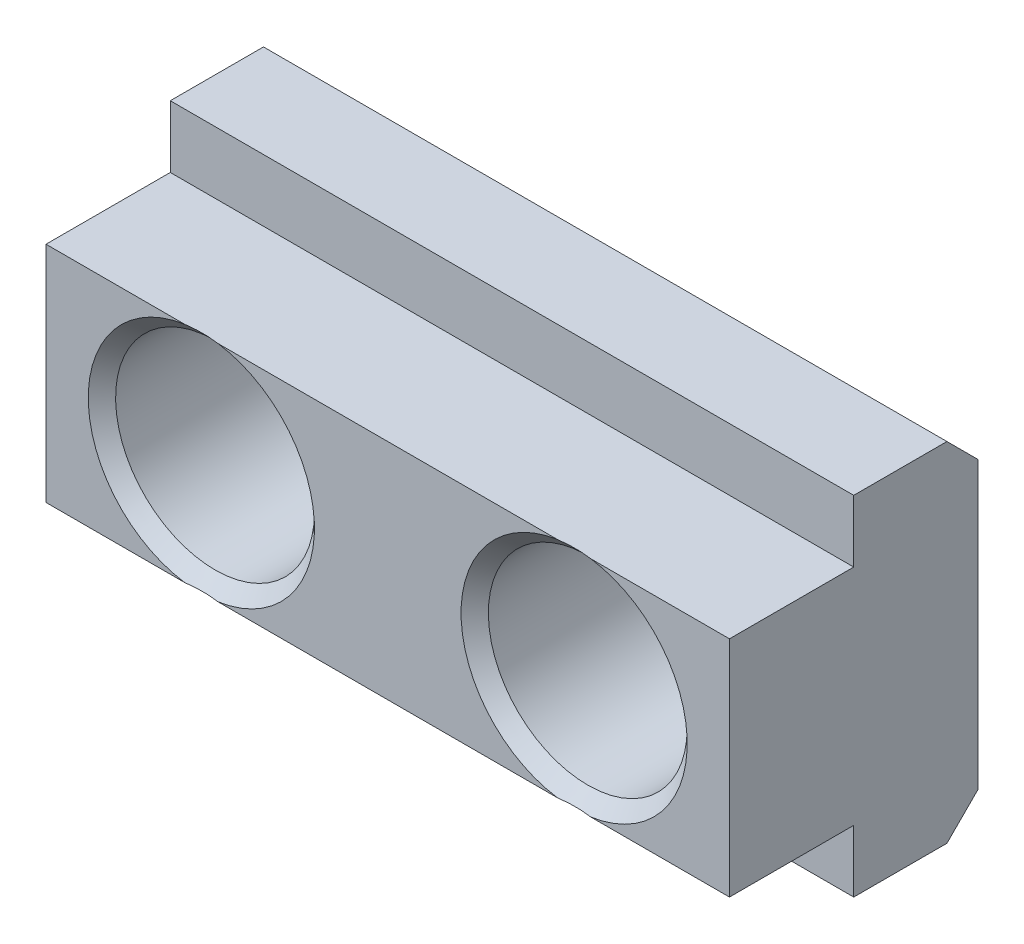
ISO-10303-21;
HEADER;
FILE_DESCRIPTION(('STEP AP214'),'2;1');
FILE_NAME('part.step','',(''),(''),'','','');
FILE_SCHEMA(('AUTOMOTIVE_DESIGN { 1 0 10303 214 1 1 1 1 }'));
ENDSEC;
DATA;
#1=APPLICATION_CONTEXT('core data for automotive mechanical design processes');
#2=APPLICATION_PROTOCOL_DEFINITION('international standard','automotive_design',2000,#1);
#3=PRODUCT_CONTEXT('',#1,'mechanical');
#4=PRODUCT('Part','Part','',(#3));
#5=PRODUCT_RELATED_PRODUCT_CATEGORY('part','',(#4));
#6=PRODUCT_DEFINITION_FORMATION('','',#4);
#7=PRODUCT_DEFINITION_CONTEXT('part definition',#1,'design');
#8=PRODUCT_DEFINITION('design','',#6,#7);
#9=PRODUCT_DEFINITION_SHAPE('','',#8);
#10=(LENGTH_UNIT() NAMED_UNIT(*) SI_UNIT(.MILLI.,.METRE.));
#11=(NAMED_UNIT(*) PLANE_ANGLE_UNIT() SI_UNIT($,.RADIAN.));
#12=(NAMED_UNIT(*) SI_UNIT($,.STERADIAN.) SOLID_ANGLE_UNIT());
#13=UNCERTAINTY_MEASURE_WITH_UNIT(LENGTH_MEASURE(1.E-05),#10,'distance_accuracy_value','');
#14=(GEOMETRIC_REPRESENTATION_CONTEXT(3) GLOBAL_UNCERTAINTY_ASSIGNED_CONTEXT((#13)) GLOBAL_UNIT_ASSIGNED_CONTEXT((#10,
#11,#12)) REPRESENTATION_CONTEXT('',''));
#15=CARTESIAN_POINT('',(0.,0.,0.));
#16=DIRECTION('',(0.,0.,1.));
#17=DIRECTION('',(1.,0.,0.));
#18=AXIS2_PLACEMENT_3D('',#15,#16,#17);
#19=CARTESIAN_POINT('',(-12.5,9.,20.));
#20=DIRECTION('',(0.,0.,-1.));
#21=DIRECTION('',(0.,-1.,0.));
#22=AXIS2_PLACEMENT_3D('',#19,#20,#21);
#23=PLANE('',#22);
#24=DIRECTION('',(1.,0.,0.));
#25=VECTOR('',#24,1.);
#26=CARTESIAN_POINT('',(-12.5,-9.,20.));
#27=LINE('',#26,#25);
#28=CARTESIAN_POINT('',(-12.5,-9.,20.));
#29=VERTEX_POINT('',#28);
#30=CARTESIAN_POINT('',(-1.34536240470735,-9.,20.));
#31=VERTEX_POINT('',#30);
#32=EDGE_CURVE('E128',#29,#31,#27,.T.);
#33=ORIENTED_EDGE('',*,*,#32,.T.);
#34=CARTESIAN_POINT('',(0.,0.,20.));
#35=DIRECTION('',(0.,0.,1.));
#36=DIRECTION('',(0.,1.,0.));
#37=AXIS2_PLACEMENT_3D('',#34,#35,#36);
#38=CIRCLE('',#37,9.1);
#39=CARTESIAN_POINT('',(-1.3453624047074,9.,20.));
#40=VERTEX_POINT('',#39);
#41=EDGE_CURVE('E116',#40,#31,#38,.T.);
#42=ORIENTED_EDGE('',*,*,#41,.F.);
#43=DIRECTION('',(1.,0.,0.));
#44=VECTOR('',#43,1.);
#45=CARTESIAN_POINT('',(-12.5,9.,20.));
#46=LINE('',#45,#44);
#47=CARTESIAN_POINT('',(-12.5,9.,20.));
#48=VERTEX_POINT('',#47);
#49=EDGE_CURVE('E125',#48,#40,#46,.T.);
#50=ORIENTED_EDGE('',*,*,#49,.F.);
#51=DIRECTION('',(0.,1.,0.));
#52=VECTOR('',#51,1.);
#53=CARTESIAN_POINT('',(-12.5,9.,20.));
#54=LINE('',#53,#52);
#55=EDGE_CURVE('E182',#29,#48,#54,.T.);
#56=ORIENTED_EDGE('',*,*,#55,.F.);
#57=EDGE_LOOP('',(#33,#42,#50,#56));
#58=FACE_BOUND('',#57,.T.);
#59=ADVANCED_FACE('F14',(#58),#23,.F.);
#60=CARTESIAN_POINT('',(1.34536240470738,9.,20.));
#61=VERTEX_POINT('',#60);
#62=CARTESIAN_POINT('',(28.6546375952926,9.,20.));
#63=VERTEX_POINT('',#62);
#64=EDGE_CURVE('E135',#61,#63,#46,.T.);
#65=ORIENTED_EDGE('',*,*,#64,.F.);
#66=CARTESIAN_POINT('',(1.34536240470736,-9.,20.));
#67=VERTEX_POINT('',#66);
#68=EDGE_CURVE('E31',#67,#61,#38,.T.);
#69=ORIENTED_EDGE('',*,*,#68,.F.);
#70=CARTESIAN_POINT('',(28.6546375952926,-9.,20.));
#71=VERTEX_POINT('',#70);
#72=EDGE_CURVE('E138',#67,#71,#27,.T.);
#73=ORIENTED_EDGE('',*,*,#72,.T.);
#74=CARTESIAN_POINT('',(30.,0.,20.));
#75=DIRECTION('',(0.,0.,1.));
#76=DIRECTION('',(0.,1.,0.));
#77=AXIS2_PLACEMENT_3D('',#74,#75,#76);
#78=CIRCLE('',#77,9.1);
#79=EDGE_CURVE('E257',#63,#71,#78,.T.);
#80=ORIENTED_EDGE('',*,*,#79,.F.);
#81=EDGE_LOOP('',(#65,#69,#73,#80));
#82=FACE_BOUND('',#81,.T.);
#83=ADVANCED_FACE('F236',(#82),#23,.F.);
#84=CARTESIAN_POINT('',(-12.5,-14.,10.));
#85=DIRECTION('',(0.,1.,0.));
#86=DIRECTION('',(0.,0.,-1.));
#87=AXIS2_PLACEMENT_3D('',#84,#85,#86);
#88=PLANE('',#87);
#89=DIRECTION('',(0.,0.,1.));
#90=VECTOR('',#89,1.);
#91=CARTESIAN_POINT('',(-12.5,-14.,10.));
#92=LINE('',#91,#90);
#93=CARTESIAN_POINT('',(-12.5,-14.,2.5));
#94=VERTEX_POINT('',#93);
#95=CARTESIAN_POINT('',(-12.5,-14.,10.));
#96=VERTEX_POINT('',#95);
#97=EDGE_CURVE('E156',#94,#96,#92,.T.);
#98=ORIENTED_EDGE('',*,*,#97,.F.);
#99=DIRECTION('',(1.,0.,0.));
#100=VECTOR('',#99,1.);
#101=CARTESIAN_POINT('',(-12.5,-14.,2.5));
#102=LINE('',#101,#100);
#103=CARTESIAN_POINT('',(42.5,-14.,2.5));
#104=VERTEX_POINT('',#103);
#105=EDGE_CURVE('E342',#94,#104,#102,.T.);
#106=ORIENTED_EDGE('',*,*,#105,.T.);
#107=DIRECTION('',(0.,0.,1.));
#108=VECTOR('',#107,1.);
#109=CARTESIAN_POINT('',(42.5,-14.,10.));
#110=LINE('',#109,#108);
#111=CARTESIAN_POINT('',(42.5,-14.,10.));
#112=VERTEX_POINT('',#111);
#113=EDGE_CURVE('E171',#104,#112,#110,.T.);
#114=ORIENTED_EDGE('',*,*,#113,.T.);
#115=DIRECTION('',(1.,0.,0.));
#116=VECTOR('',#115,1.);
#117=CARTESIAN_POINT('',(-12.5,-14.,10.));
#118=LINE('',#117,#116);
#119=EDGE_CURVE('E344',#96,#112,#118,.T.);
#120=ORIENTED_EDGE('',*,*,#119,.F.);
#121=EDGE_LOOP('',(#98,#106,#114,#120));
#122=FACE_BOUND('',#121,.T.);
#123=ADVANCED_FACE('F246',(#122),#88,.F.);
#124=CARTESIAN_POINT('',(-12.5,-9.,10.));
#125=DIRECTION('',(0.,0.,-1.));
#126=DIRECTION('',(0.,-1.,0.));
#127=AXIS2_PLACEMENT_3D('',#124,#125,#126);
#128=PLANE('',#127);
#129=DIRECTION('',(0.,1.,0.));
#130=VECTOR('',#129,1.);
#131=CARTESIAN_POINT('',(42.5,-9.,10.));
#132=LINE('',#131,#130);
#133=CARTESIAN_POINT('',(42.5,-9.,10.));
#134=VERTEX_POINT('',#133);
#135=EDGE_CURVE('E169',#112,#134,#132,.T.);
#136=ORIENTED_EDGE('',*,*,#135,.T.);
#137=DIRECTION('',(1.,0.,0.));
#138=VECTOR('',#137,1.);
#139=CARTESIAN_POINT('',(-12.5,-9.,10.));
#140=LINE('',#139,#138);
#141=CARTESIAN_POINT('',(-12.5,-9.,10.));
#142=VERTEX_POINT('',#141);
#143=EDGE_CURVE('E349',#142,#134,#140,.T.);
#144=ORIENTED_EDGE('',*,*,#143,.F.);
#145=DIRECTION('',(0.,1.,0.));
#146=VECTOR('',#145,1.);
#147=CARTESIAN_POINT('',(-12.5,-9.,10.));
#148=LINE('',#147,#146);
#149=EDGE_CURVE('E186',#96,#142,#148,.T.);
#150=ORIENTED_EDGE('',*,*,#149,.F.);
#151=ORIENTED_EDGE('',*,*,#119,.T.);
#152=EDGE_LOOP('',(#136,#144,#150,#151));
#153=FACE_BOUND('',#152,.T.);
#154=ADVANCED_FACE('F242',(#153),#128,.F.);
#155=CARTESIAN_POINT('',(-12.5,-9.,20.));
#156=DIRECTION('',(0.,1.,0.));
#157=DIRECTION('',(0.,0.,-1.));
#158=AXIS2_PLACEMENT_3D('',#155,#156,#157);
#159=PLANE('',#158);
#160=ORIENTED_EDGE('',*,*,#72,.F.);
#161=CARTESIAN_POINT('',(19.4489634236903,-9.,32.3304031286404));
#162=CARTESIAN_POINT('',(19.035900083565,-9.,31.9555709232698));
#163=CARTESIAN_POINT('',(18.6218227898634,-9.,31.58184864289));
#164=CARTESIAN_POINT('',(17.7911512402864,-9.,30.837170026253));
#165=CARTESIAN_POINT('',(17.3745568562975,-9.,30.4662138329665));
#166=CARTESIAN_POINT('',(16.5374420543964,-9.,29.7268020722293));
#167=CARTESIAN_POINT('',(16.1169148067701,-9.,29.358354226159));
#168=CARTESIAN_POINT('',(15.272259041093,-9.,28.6256233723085));
#169=CARTESIAN_POINT('',(14.8481305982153,-9.,28.2613402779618));
#170=CARTESIAN_POINT('',(13.95665798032,-9.,27.5050461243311));
#171=CARTESIAN_POINT('',(13.4888937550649,-9.,27.1135288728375));
#172=CARTESIAN_POINT('',(12.5467436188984,-9.,26.3385549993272));
#173=CARTESIAN_POINT('',(12.0723578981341,-9.,25.9550981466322));
#174=CARTESIAN_POINT('',(11.1155702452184,-9.,25.1992884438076));
#175=CARTESIAN_POINT('',(10.6331772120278,-9.,24.8269244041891));
#176=CARTESIAN_POINT('',(9.90132783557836,-9.,24.279472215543));
#177=CARTESIAN_POINT('',(9.65601353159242,-9.,24.0988456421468));
#178=CARTESIAN_POINT('',(9.16220726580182,-9.,23.7419960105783));
#179=CARTESIAN_POINT('',(8.91371540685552,-9.,23.5657728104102));
#180=CARTESIAN_POINT('',(8.40474323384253,-9.,23.2127974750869));
#181=CARTESIAN_POINT('',(8.14413926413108,-9.,23.0362231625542));
#182=CARTESIAN_POINT('',(7.61844979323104,-9.,22.6898967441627));
#183=CARTESIAN_POINT('',(7.35336462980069,-9.,22.5201441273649));
#184=CARTESIAN_POINT('',(6.8176146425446,-9.,22.1887330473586));
#185=CARTESIAN_POINT('',(6.54694210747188,-9.,22.027086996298));
#186=CARTESIAN_POINT('',(5.99966078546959,-9.,21.7141354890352));
#187=CARTESIAN_POINT('',(5.72305218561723,-9.,21.5628297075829));
#188=CARTESIAN_POINT('',(5.16962404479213,-9.,21.2764279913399));
#189=CARTESIAN_POINT('',(4.89295782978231,-9.,21.1410377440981));
#190=CARTESIAN_POINT('',(4.33257764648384,-9.,20.8854425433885));
#191=CARTESIAN_POINT('',(4.04886252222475,-9.,20.765240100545));
#192=CARTESIAN_POINT('',(3.47494537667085,-9.,20.5439291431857));
#193=CARTESIAN_POINT('',(3.18476441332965,-9.,20.4427665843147));
#194=CARTESIAN_POINT('',(2.59753433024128,-9.,20.2631842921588));
#195=CARTESIAN_POINT('',(2.30049000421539,-9.,20.1847491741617));
#196=CARTESIAN_POINT('',(1.77741180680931,-9.,20.0712439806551));
#197=CARTESIAN_POINT('',(1.55266973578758,-9.,20.0302126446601));
#198=CARTESIAN_POINT('',(1.10078097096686,-9.,19.9643140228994));
#199=CARTESIAN_POINT('',(0.873634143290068,-9.,19.9394476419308));
#200=CARTESIAN_POINT('',(0.418379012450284,-9.,19.906862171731));
#201=CARTESIAN_POINT('',(0.190272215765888,-9.,19.8991222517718));
#202=CARTESIAN_POINT('',(-0.265869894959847,-9.,19.9010364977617));
#203=CARTESIAN_POINT('',(-0.493905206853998,-9.,19.9106911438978));
#204=CARTESIAN_POINT('',(-0.980721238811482,-9.,19.9495831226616));
#205=CARTESIAN_POINT('',(-1.23929674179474,-9.,19.9813930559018));
#206=CARTESIAN_POINT('',(-1.75310125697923,-9.,20.0656463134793));
#207=CARTESIAN_POINT('',(-2.00832935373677,-9.,20.1180951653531));
#208=CARTESIAN_POINT('',(-2.38899117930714,-9.,20.2108484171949));
#209=CARTESIAN_POINT('',(-2.51614163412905,-9.,20.2443149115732));
#210=CARTESIAN_POINT('',(-2.76917657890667,-9.,20.3156048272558));
#211=CARTESIAN_POINT('',(-2.89506143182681,-9.,20.3534269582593));
#212=CARTESIAN_POINT('',(-3.27073621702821,-9.,20.472948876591));
#213=CARTESIAN_POINT('',(-3.51860487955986,-9.,20.5607187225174));
#214=CARTESIAN_POINT('',(-4.1076520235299,-9.,20.7879755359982));
#215=CARTESIAN_POINT('',(-4.4462653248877,-9.,20.9340654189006));
#216=CARTESIAN_POINT('',(-5.11376654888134,-9.,21.2471565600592));
#217=CARTESIAN_POINT('',(-5.4426488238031,-9.,21.4141696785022));
#218=CARTESIAN_POINT('',(-6.09285341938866,-9.,21.7649746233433));
#219=CARTESIAN_POINT('',(-6.41414294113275,-9.,21.9488267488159));
#220=CARTESIAN_POINT('',(-7.04904977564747,-9.,22.3291081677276));
#221=CARTESIAN_POINT('',(-7.36266861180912,-9.,22.525534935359));
#222=CARTESIAN_POINT('',(-7.96861210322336,-9.,22.9186617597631));
#223=CARTESIAN_POINT('',(-8.26123802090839,-9.,23.1148998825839));
#224=CARTESIAN_POINT('',(-8.84152677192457,-9.,23.5146100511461));
#225=CARTESIAN_POINT('',(-9.12918919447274,-9.,23.7180826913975));
#226=CARTESIAN_POINT('',(-9.69771119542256,-9.,24.1290318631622));
#227=CARTESIAN_POINT('',(-9.97860862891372,-9.,24.3364562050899));
#228=CARTESIAN_POINT('',(-10.5367418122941,-9.,24.7560263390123));
#229=CARTESIAN_POINT('',(-10.8139785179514,-9.,24.9681708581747));
#230=CARTESIAN_POINT('',(-11.0897133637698,-9.,25.1822177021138));
#231=B_SPLINE_CURVE_WITH_KNOTS('',3,(#161,#162,#163,#164,#165,#166,#167,#168,#169,#170,#171,
#172,#173,#174,#175,#176,#177,#178,#179,#180,#181,#182,#183,#184,#185,#186,#187,#188,#189,#190,
#191,#192,#193,#194,#195,#196,#197,#198,#199,#200,#201,#202,#203,#204,#205,#206,#207,#208,#209,
#210,#211,#212,#213,#214,#215,#216,#217,#218,#219,#220,#221,#222,#223,#224,#225,#226,#227,#228,
#229,#230),.UNSPECIFIED.,.F.,.F.,(4,2,2,2,2,2,2,2,2,2,2,2,2,2,2,2,2,2,2,2,2,2,2,2,2,2,2,2,2,2,2,
2,2,2,4),(0.,1.67335071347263,3.34678732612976,5.02407585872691,6.70132946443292,
8.53123159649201,10.3610812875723,12.189017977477,13.1028974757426,14.0167474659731,
14.9610306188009,15.9052429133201,16.8508593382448,17.7964460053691,18.7201276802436,
19.643961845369,20.5651328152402,21.485678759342,22.1705265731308,22.8554127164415,
23.5394653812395,24.2235369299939,25.0041999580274,25.7850722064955,26.1794494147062,
26.5737100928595,27.3620509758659,28.4674473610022,29.5734731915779,30.6836272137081,
31.7935589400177,32.8504320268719,33.9073921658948,34.95488475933,36.0020982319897),.UNSPECIFIED.);
#232=EDGE_CURVE('E263',#67,#31,#231,.T.);
#233=ORIENTED_EDGE('',*,*,#232,.T.);
#234=ORIENTED_EDGE('',*,*,#32,.F.);
#235=DIRECTION('',(0.,0.,1.));
#236=VECTOR('',#235,1.);
#237=CARTESIAN_POINT('',(-12.5,-9.,20.));
#238=LINE('',#237,#236);
#239=EDGE_CURVE('E184',#142,#29,#238,.T.);
#240=ORIENTED_EDGE('',*,*,#239,.F.);
#241=ORIENTED_EDGE('',*,*,#143,.T.);
#242=DIRECTION('',(0.,0.,1.));
#243=VECTOR('',#242,1.);
#244=CARTESIAN_POINT('',(42.5,-9.,20.));
#245=LINE('',#244,#243);
#246=CARTESIAN_POINT('',(42.5,-9.,20.));
#247=VERTEX_POINT('',#246);
#248=EDGE_CURVE('E166',#134,#247,#245,.T.);
#249=ORIENTED_EDGE('',*,*,#248,.T.);
#250=CARTESIAN_POINT('',(31.3453624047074,-9.,20.));
#251=VERTEX_POINT('',#250);
#252=EDGE_CURVE('E134',#251,#247,#27,.T.);
#253=ORIENTED_EDGE('',*,*,#252,.F.);
#254=CARTESIAN_POINT('',(49.4489634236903,-9.,32.3304031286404));
#255=CARTESIAN_POINT('',(49.035900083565,-9.,31.9555709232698));
#256=CARTESIAN_POINT('',(48.6218227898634,-9.,31.58184864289));
#257=CARTESIAN_POINT('',(47.7911512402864,-9.,30.837170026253));
#258=CARTESIAN_POINT('',(47.3745568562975,-9.,30.4662138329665));
#259=CARTESIAN_POINT('',(46.5374420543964,-9.,29.7268020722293));
#260=CARTESIAN_POINT('',(46.1169148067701,-9.,29.358354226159));
#261=CARTESIAN_POINT('',(45.272259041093,-9.,28.6256233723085));
#262=CARTESIAN_POINT('',(44.8481305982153,-9.,28.2613402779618));
#263=CARTESIAN_POINT('',(43.95665798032,-9.,27.5050461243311));
#264=CARTESIAN_POINT('',(43.4888937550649,-9.,27.1135288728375));
#265=CARTESIAN_POINT('',(42.5467436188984,-9.,26.3385549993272));
#266=CARTESIAN_POINT('',(42.0723578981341,-9.,25.9550981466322));
#267=CARTESIAN_POINT('',(41.1155702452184,-9.,25.1992884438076));
#268=CARTESIAN_POINT('',(40.6331772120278,-9.,24.8269244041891));
#269=CARTESIAN_POINT('',(39.9013278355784,-9.,24.279472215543));
#270=CARTESIAN_POINT('',(39.6560135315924,-9.,24.0988456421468));
#271=CARTESIAN_POINT('',(39.1622072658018,-9.,23.7419960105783));
#272=CARTESIAN_POINT('',(38.9137154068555,-9.,23.5657728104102));
#273=CARTESIAN_POINT('',(38.4047432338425,-9.,23.2127974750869));
#274=CARTESIAN_POINT('',(38.1441392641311,-9.,23.0362231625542));
#275=CARTESIAN_POINT('',(37.618449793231,-9.,22.6898967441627));
#276=CARTESIAN_POINT('',(37.3533646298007,-9.,22.5201441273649));
#277=CARTESIAN_POINT('',(36.8176146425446,-9.,22.1887330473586));
#278=CARTESIAN_POINT('',(36.5469421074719,-9.,22.027086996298));
#279=CARTESIAN_POINT('',(35.9996607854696,-9.,21.7141354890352));
#280=CARTESIAN_POINT('',(35.7230521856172,-9.,21.5628297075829));
#281=CARTESIAN_POINT('',(35.1696240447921,-9.,21.2764279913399));
#282=CARTESIAN_POINT('',(34.8929578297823,-9.,21.1410377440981));
#283=CARTESIAN_POINT('',(34.3325776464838,-9.,20.8854425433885));
#284=CARTESIAN_POINT('',(34.0488625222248,-9.,20.765240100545));
#285=CARTESIAN_POINT('',(33.4749453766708,-9.,20.5439291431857));
#286=CARTESIAN_POINT('',(33.1847644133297,-9.,20.4427665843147));
#287=CARTESIAN_POINT('',(32.5975343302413,-9.,20.2631842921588));
#288=CARTESIAN_POINT('',(32.3004900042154,-9.,20.1847491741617));
#289=CARTESIAN_POINT('',(31.7774118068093,-9.,20.0712439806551));
#290=CARTESIAN_POINT('',(31.5526697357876,-9.,20.0302126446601));
#291=CARTESIAN_POINT('',(31.1007809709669,-9.,19.9643140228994));
#292=CARTESIAN_POINT('',(30.8736341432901,-9.,19.9394476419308));
#293=CARTESIAN_POINT('',(30.4183790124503,-9.,19.906862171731));
#294=CARTESIAN_POINT('',(30.1902722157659,-9.,19.8991222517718));
#295=CARTESIAN_POINT('',(29.7341301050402,-9.,19.9010364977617));
#296=CARTESIAN_POINT('',(29.506094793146,-9.,19.9106911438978));
#297=CARTESIAN_POINT('',(29.0192787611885,-9.,19.9495831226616));
#298=CARTESIAN_POINT('',(28.7607032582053,-9.,19.9813930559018));
#299=CARTESIAN_POINT('',(28.2468987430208,-9.,20.0656463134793));
#300=CARTESIAN_POINT('',(27.9916706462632,-9.,20.1180951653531));
#301=CARTESIAN_POINT('',(27.6110088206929,-9.,20.2108484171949));
#302=CARTESIAN_POINT('',(27.4838583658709,-9.,20.2443149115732));
#303=CARTESIAN_POINT('',(27.2308234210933,-9.,20.3156048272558));
#304=CARTESIAN_POINT('',(27.1049385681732,-9.,20.3534269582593));
#305=CARTESIAN_POINT('',(26.7292637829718,-9.,20.472948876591));
#306=CARTESIAN_POINT('',(26.4813951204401,-9.,20.5607187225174));
#307=CARTESIAN_POINT('',(25.8923479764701,-9.,20.7879755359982));
#308=CARTESIAN_POINT('',(25.5537346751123,-9.,20.9340654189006));
#309=CARTESIAN_POINT('',(24.8862334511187,-9.,21.2471565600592));
#310=CARTESIAN_POINT('',(24.5573511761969,-9.,21.4141696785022));
#311=CARTESIAN_POINT('',(23.9071465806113,-9.,21.7649746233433));
#312=CARTESIAN_POINT('',(23.5858570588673,-9.,21.9488267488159));
#313=CARTESIAN_POINT('',(22.9509502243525,-9.,22.3291081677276));
#314=CARTESIAN_POINT('',(22.6373313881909,-9.,22.525534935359));
#315=CARTESIAN_POINT('',(22.0313878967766,-9.,22.9186617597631));
#316=CARTESIAN_POINT('',(21.7387619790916,-9.,23.1148998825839));
#317=CARTESIAN_POINT('',(21.1584732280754,-9.,23.5146100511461));
#318=CARTESIAN_POINT('',(20.8708108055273,-9.,23.7180826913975));
#319=CARTESIAN_POINT('',(20.3022888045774,-9.,24.1290318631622));
#320=CARTESIAN_POINT('',(20.0213913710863,-9.,24.3364562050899));
#321=CARTESIAN_POINT('',(19.4632581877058,-9.,24.7560263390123));
#322=CARTESIAN_POINT('',(19.1860214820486,-9.,24.9681708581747));
#323=CARTESIAN_POINT('',(18.9102866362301,-9.,25.1822177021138));
#324=B_SPLINE_CURVE_WITH_KNOTS('',3,(#254,#255,#256,#257,#258,#259,#260,#261,#262,#263,#264,
#265,#266,#267,#268,#269,#270,#271,#272,#273,#274,#275,#276,#277,#278,#279,#280,#281,#282,#283,
#284,#285,#286,#287,#288,#289,#290,#291,#292,#293,#294,#295,#296,#297,#298,#299,#300,#301,#302,
#303,#304,#305,#306,#307,#308,#309,#310,#311,#312,#313,#314,#315,#316,#317,#318,#319,#320,#321,
#322,#323),.UNSPECIFIED.,.F.,.F.,(4,2,2,2,2,2,2,2,2,2,2,2,2,2,2,2,2,2,2,2,2,2,2,2,2,2,2,2,2,2,2,
2,2,2,4),(0.,1.67335071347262,3.34678732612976,5.0240758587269,6.70132946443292,
8.53123159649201,10.3610812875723,12.189017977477,13.1028974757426,14.0167474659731,
14.9610306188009,15.9052429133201,16.8508593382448,17.796446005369,18.7201276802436,
19.643961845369,20.5651328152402,21.485678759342,22.1705265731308,22.8554127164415,
23.5394653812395,24.2235369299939,25.0041999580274,25.7850722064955,26.1794494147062,
26.5737100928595,27.3620509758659,28.4674473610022,29.5734731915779,30.6836272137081,
31.7935589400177,32.8504320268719,33.9073921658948,34.95488475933,36.0020982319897),.UNSPECIFIED.);
#325=EDGE_CURVE('E173',#251,#71,#324,.T.);
#326=ORIENTED_EDGE('',*,*,#325,.T.);
#327=EDGE_LOOP('',(#160,#233,#234,#240,#241,#249,#253,#326));
#328=FACE_BOUND('',#327,.T.);
#329=ADVANCED_FACE('F199',(#328),#159,.F.);
#330=CARTESIAN_POINT('',(31.3453624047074,9.,20.));
#331=VERTEX_POINT('',#330);
#332=CARTESIAN_POINT('',(42.5,9.,20.));
#333=VERTEX_POINT('',#332);
#334=EDGE_CURVE('E137',#331,#333,#46,.T.);
#335=ORIENTED_EDGE('',*,*,#334,.F.);
#336=EDGE_CURVE('E38',#251,#331,#78,.T.);
#337=ORIENTED_EDGE('',*,*,#336,.F.);
#338=ORIENTED_EDGE('',*,*,#252,.T.);
#339=DIRECTION('',(0.,1.,0.));
#340=VECTOR('',#339,1.);
#341=CARTESIAN_POINT('',(42.5,9.,20.));
#342=LINE('',#341,#340);
#343=EDGE_CURVE('E164',#247,#333,#342,.T.);
#344=ORIENTED_EDGE('',*,*,#343,.T.);
#345=EDGE_LOOP('',(#335,#337,#338,#344));
#346=FACE_BOUND('',#345,.T.);
#347=ADVANCED_FACE('F231',(#346),#23,.F.);
#348=CARTESIAN_POINT('',(-12.5,9.,10.));
#349=DIRECTION('',(0.,-1.,0.));
#350=DIRECTION('',(0.,0.,1.));
#351=AXIS2_PLACEMENT_3D('',#348,#349,#350);
#352=PLANE('',#351);
#353=ORIENTED_EDGE('',*,*,#49,.T.);
#354=CARTESIAN_POINT('',(19.4489634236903,9.,32.3304031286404));
#355=CARTESIAN_POINT('',(19.035900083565,9.,31.9555709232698));
#356=CARTESIAN_POINT('',(18.6218227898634,9.,31.58184864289));
#357=CARTESIAN_POINT('',(17.7911512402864,9.,30.837170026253));
#358=CARTESIAN_POINT('',(17.3745568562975,9.,30.4662138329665));
#359=CARTESIAN_POINT('',(16.5374420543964,9.,29.7268020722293));
#360=CARTESIAN_POINT('',(16.1169148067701,9.,29.358354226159));
#361=CARTESIAN_POINT('',(15.272259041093,9.,28.6256233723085));
#362=CARTESIAN_POINT('',(14.8481305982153,9.,28.2613402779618));
#363=CARTESIAN_POINT('',(13.95665798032,9.,27.5050461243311));
#364=CARTESIAN_POINT('',(13.4888937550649,9.,27.1135288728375));
#365=CARTESIAN_POINT('',(12.5467436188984,9.,26.3385549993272));
#366=CARTESIAN_POINT('',(12.0723578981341,9.,25.9550981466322));
#367=CARTESIAN_POINT('',(11.1155702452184,9.,25.1992884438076));
#368=CARTESIAN_POINT('',(10.6331772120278,9.,24.8269244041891));
#369=CARTESIAN_POINT('',(9.90132783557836,9.,24.279472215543));
#370=CARTESIAN_POINT('',(9.65601353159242,9.,24.0988456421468));
#371=CARTESIAN_POINT('',(9.16220726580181,9.,23.7419960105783));
#372=CARTESIAN_POINT('',(8.91371540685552,9.,23.5657728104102));
#373=CARTESIAN_POINT('',(8.40474323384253,9.,23.2127974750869));
#374=CARTESIAN_POINT('',(8.14413926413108,9.,23.0362231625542));
#375=CARTESIAN_POINT('',(7.61844979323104,9.,22.6898967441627));
#376=CARTESIAN_POINT('',(7.35336462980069,9.,22.5201441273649));
#377=CARTESIAN_POINT('',(6.8176146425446,9.,22.1887330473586));
#378=CARTESIAN_POINT('',(6.54694210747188,9.,22.027086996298));
#379=CARTESIAN_POINT('',(5.99966078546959,9.,21.7141354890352));
#380=CARTESIAN_POINT('',(5.72305218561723,9.,21.5628297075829));
#381=CARTESIAN_POINT('',(5.16962404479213,9.,21.2764279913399));
#382=CARTESIAN_POINT('',(4.89295782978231,9.,21.1410377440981));
#383=CARTESIAN_POINT('',(4.33257764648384,9.,20.8854425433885));
#384=CARTESIAN_POINT('',(4.04886252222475,9.,20.765240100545));
#385=CARTESIAN_POINT('',(3.47494537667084,9.,20.5439291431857));
#386=CARTESIAN_POINT('',(3.18476441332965,9.,20.4427665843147));
#387=CARTESIAN_POINT('',(2.59753433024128,9.,20.2631842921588));
#388=CARTESIAN_POINT('',(2.30049000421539,9.,20.1847491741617));
#389=CARTESIAN_POINT('',(1.77741180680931,9.,20.0712439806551));
#390=CARTESIAN_POINT('',(1.55266973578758,9.,20.0302126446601));
#391=CARTESIAN_POINT('',(1.10078097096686,9.,19.9643140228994));
#392=CARTESIAN_POINT('',(0.873634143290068,9.,19.9394476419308));
#393=CARTESIAN_POINT('',(0.418379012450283,9.,19.906862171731));
#394=CARTESIAN_POINT('',(0.190272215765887,9.,19.8991222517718));
#395=CARTESIAN_POINT('',(-0.265869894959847,9.,19.9010364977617));
#396=CARTESIAN_POINT('',(-0.493905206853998,9.,19.9106911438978));
#397=CARTESIAN_POINT('',(-0.980721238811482,9.,19.9495831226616));
#398=CARTESIAN_POINT('',(-1.23929674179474,9.,19.9813930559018));
#399=CARTESIAN_POINT('',(-1.75310125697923,9.,20.0656463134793));
#400=CARTESIAN_POINT('',(-2.00832935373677,9.,20.1180951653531));
#401=CARTESIAN_POINT('',(-2.38899117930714,9.,20.2108484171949));
#402=CARTESIAN_POINT('',(-2.51614163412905,9.,20.2443149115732));
#403=CARTESIAN_POINT('',(-2.76917657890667,9.,20.3156048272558));
#404=CARTESIAN_POINT('',(-2.89506143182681,9.,20.3534269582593));
#405=CARTESIAN_POINT('',(-3.27073621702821,9.,20.472948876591));
#406=CARTESIAN_POINT('',(-3.51860487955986,9.,20.5607187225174));
#407=CARTESIAN_POINT('',(-4.1076520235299,9.,20.7879755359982));
#408=CARTESIAN_POINT('',(-4.44626532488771,9.,20.9340654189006));
#409=CARTESIAN_POINT('',(-5.11376654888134,9.,21.2471565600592));
#410=CARTESIAN_POINT('',(-5.4426488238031,9.,21.4141696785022));
#411=CARTESIAN_POINT('',(-6.09285341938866,9.,21.7649746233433));
#412=CARTESIAN_POINT('',(-6.41414294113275,9.,21.9488267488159));
#413=CARTESIAN_POINT('',(-7.04904977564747,9.,22.3291081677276));
#414=CARTESIAN_POINT('',(-7.36266861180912,9.,22.525534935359));
#415=CARTESIAN_POINT('',(-7.96861210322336,9.,22.9186617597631));
#416=CARTESIAN_POINT('',(-8.26123802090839,9.,23.1148998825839));
#417=CARTESIAN_POINT('',(-8.84152677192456,9.,23.5146100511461));
#418=CARTESIAN_POINT('',(-9.12918919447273,9.,23.7180826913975));
#419=CARTESIAN_POINT('',(-9.69771119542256,9.,24.1290318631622));
#420=CARTESIAN_POINT('',(-9.97860862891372,9.,24.3364562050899));
#421=CARTESIAN_POINT('',(-10.5367418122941,9.,24.7560263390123));
#422=CARTESIAN_POINT('',(-10.8139785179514,9.,24.9681708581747));
#423=CARTESIAN_POINT('',(-11.0897133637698,9.,25.1822177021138));
#424=B_SPLINE_CURVE_WITH_KNOTS('',3,(#354,#355,#356,#357,#358,#359,#360,#361,#362,#363,#364,
#365,#366,#367,#368,#369,#370,#371,#372,#373,#374,#375,#376,#377,#378,#379,#380,#381,#382,#383,
#384,#385,#386,#387,#388,#389,#390,#391,#392,#393,#394,#395,#396,#397,#398,#399,#400,#401,#402,
#403,#404,#405,#406,#407,#408,#409,#410,#411,#412,#413,#414,#415,#416,#417,#418,#419,#420,#421,
#422,#423),.UNSPECIFIED.,.F.,.F.,(4,2,2,2,2,2,2,2,2,2,2,2,2,2,2,2,2,2,2,2,2,2,2,2,2,2,2,2,2,2,2,
2,2,2,4),(0.,1.67335071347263,3.34678732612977,5.02407585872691,6.70132946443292,
8.53123159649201,10.3610812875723,12.189017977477,13.1028974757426,14.0167474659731,
14.9610306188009,15.9052429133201,16.8508593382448,17.7964460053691,18.7201276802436,
19.643961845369,20.5651328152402,21.485678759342,22.1705265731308,22.8554127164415,
23.5394653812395,24.2235369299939,25.0041999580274,25.7850722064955,26.1794494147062,
26.5737100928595,27.3620509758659,28.4674473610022,29.5734731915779,30.6836272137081,
31.7935589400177,32.8504320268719,33.9073921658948,34.95488475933,36.0020982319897),.UNSPECIFIED.);
#425=EDGE_CURVE('E9',#40,#61,#424,.F.);
#426=ORIENTED_EDGE('',*,*,#425,.T.);
#427=ORIENTED_EDGE('',*,*,#64,.T.);
#428=CARTESIAN_POINT('',(49.4489634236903,9.,32.3304031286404));
#429=CARTESIAN_POINT('',(49.035900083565,9.,31.9555709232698));
#430=CARTESIAN_POINT('',(48.6218227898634,9.,31.58184864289));
#431=CARTESIAN_POINT('',(47.7911512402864,9.,30.837170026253));
#432=CARTESIAN_POINT('',(47.3745568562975,9.,30.4662138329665));
#433=CARTESIAN_POINT('',(46.5374420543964,9.,29.7268020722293));
#434=CARTESIAN_POINT('',(46.1169148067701,9.,29.358354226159));
#435=CARTESIAN_POINT('',(45.272259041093,9.,28.6256233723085));
#436=CARTESIAN_POINT('',(44.8481305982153,9.,28.2613402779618));
#437=CARTESIAN_POINT('',(43.95665798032,9.,27.5050461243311));
#438=CARTESIAN_POINT('',(43.4888937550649,9.,27.1135288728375));
#439=CARTESIAN_POINT('',(42.5467436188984,9.,26.3385549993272));
#440=CARTESIAN_POINT('',(42.0723578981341,9.,25.9550981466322));
#441=CARTESIAN_POINT('',(41.1155702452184,9.,25.1992884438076));
#442=CARTESIAN_POINT('',(40.6331772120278,9.,24.8269244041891));
#443=CARTESIAN_POINT('',(39.9013278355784,9.,24.279472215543));
#444=CARTESIAN_POINT('',(39.6560135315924,9.,24.0988456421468));
#445=CARTESIAN_POINT('',(39.1622072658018,9.,23.7419960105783));
#446=CARTESIAN_POINT('',(38.9137154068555,9.,23.5657728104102));
#447=CARTESIAN_POINT('',(38.4047432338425,9.,23.2127974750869));
#448=CARTESIAN_POINT('',(38.1441392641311,9.,23.0362231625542));
#449=CARTESIAN_POINT('',(37.618449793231,9.,22.6898967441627));
#450=CARTESIAN_POINT('',(37.3533646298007,9.,22.5201441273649));
#451=CARTESIAN_POINT('',(36.8176146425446,9.,22.1887330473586));
#452=CARTESIAN_POINT('',(36.5469421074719,9.,22.027086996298));
#453=CARTESIAN_POINT('',(35.9996607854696,9.,21.7141354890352));
#454=CARTESIAN_POINT('',(35.7230521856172,9.,21.5628297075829));
#455=CARTESIAN_POINT('',(35.1696240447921,9.,21.2764279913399));
#456=CARTESIAN_POINT('',(34.8929578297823,9.,21.1410377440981));
#457=CARTESIAN_POINT('',(34.3325776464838,9.,20.8854425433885));
#458=CARTESIAN_POINT('',(34.0488625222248,9.,20.765240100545));
#459=CARTESIAN_POINT('',(33.4749453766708,9.,20.5439291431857));
#460=CARTESIAN_POINT('',(33.1847644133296,9.,20.4427665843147));
#461=CARTESIAN_POINT('',(32.5975343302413,9.,20.2631842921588));
#462=CARTESIAN_POINT('',(32.3004900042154,9.,20.1847491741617));
#463=CARTESIAN_POINT('',(31.7774118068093,9.,20.0712439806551));
#464=CARTESIAN_POINT('',(31.5526697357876,9.,20.0302126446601));
#465=CARTESIAN_POINT('',(31.1007809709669,9.,19.9643140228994));
#466=CARTESIAN_POINT('',(30.8736341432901,9.,19.9394476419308));
#467=CARTESIAN_POINT('',(30.4183790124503,9.,19.906862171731));
#468=CARTESIAN_POINT('',(30.1902722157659,9.,19.8991222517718));
#469=CARTESIAN_POINT('',(29.7341301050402,9.,19.9010364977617));
#470=CARTESIAN_POINT('',(29.506094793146,9.,19.9106911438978));
#471=CARTESIAN_POINT('',(29.0192787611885,9.,19.9495831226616));
#472=CARTESIAN_POINT('',(28.7607032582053,9.,19.9813930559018));
#473=CARTESIAN_POINT('',(28.2468987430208,9.,20.0656463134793));
#474=CARTESIAN_POINT('',(27.9916706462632,9.,20.1180951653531));
#475=CARTESIAN_POINT('',(27.6110088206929,9.,20.2108484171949));
#476=CARTESIAN_POINT('',(27.4838583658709,9.,20.2443149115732));
#477=CARTESIAN_POINT('',(27.2308234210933,9.,20.3156048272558));
#478=CARTESIAN_POINT('',(27.1049385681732,9.,20.3534269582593));
#479=CARTESIAN_POINT('',(26.7292637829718,9.,20.472948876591));
#480=CARTESIAN_POINT('',(26.4813951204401,9.,20.5607187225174));
#481=CARTESIAN_POINT('',(25.8923479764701,9.,20.7879755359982));
#482=CARTESIAN_POINT('',(25.5537346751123,9.,20.9340654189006));
#483=CARTESIAN_POINT('',(24.8862334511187,9.,21.2471565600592));
#484=CARTESIAN_POINT('',(24.5573511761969,9.,21.4141696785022));
#485=CARTESIAN_POINT('',(23.9071465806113,9.,21.7649746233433));
#486=CARTESIAN_POINT('',(23.5858570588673,9.,21.9488267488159));
#487=CARTESIAN_POINT('',(22.9509502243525,9.,22.3291081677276));
#488=CARTESIAN_POINT('',(22.6373313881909,9.,22.525534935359));
#489=CARTESIAN_POINT('',(22.0313878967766,9.,22.9186617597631));
#490=CARTESIAN_POINT('',(21.7387619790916,9.,23.1148998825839));
#491=CARTESIAN_POINT('',(21.1584732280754,9.,23.5146100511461));
#492=CARTESIAN_POINT('',(20.8708108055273,9.,23.7180826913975));
#493=CARTESIAN_POINT('',(20.3022888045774,9.,24.1290318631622));
#494=CARTESIAN_POINT('',(20.0213913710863,9.,24.3364562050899));
#495=CARTESIAN_POINT('',(19.4632581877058,9.,24.7560263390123));
#496=CARTESIAN_POINT('',(19.1860214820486,9.,24.9681708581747));
#497=CARTESIAN_POINT('',(18.9102866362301,9.,25.1822177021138));
#498=B_SPLINE_CURVE_WITH_KNOTS('',3,(#428,#429,#430,#431,#432,#433,#434,#435,#436,#437,#438,
#439,#440,#441,#442,#443,#444,#445,#446,#447,#448,#449,#450,#451,#452,#453,#454,#455,#456,#457,
#458,#459,#460,#461,#462,#463,#464,#465,#466,#467,#468,#469,#470,#471,#472,#473,#474,#475,#476,
#477,#478,#479,#480,#481,#482,#483,#484,#485,#486,#487,#488,#489,#490,#491,#492,#493,#494,#495,
#496,#497),.UNSPECIFIED.,.F.,.F.,(4,2,2,2,2,2,2,2,2,2,2,2,2,2,2,2,2,2,2,2,2,2,2,2,2,2,2,2,2,2,2,
2,2,2,4),(0.,1.67335071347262,3.34678732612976,5.0240758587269,6.70132946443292,
8.53123159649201,10.3610812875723,12.189017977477,13.1028974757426,14.0167474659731,
14.9610306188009,15.9052429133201,16.8508593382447,17.796446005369,18.7201276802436,
19.643961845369,20.5651328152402,21.485678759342,22.1705265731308,22.8554127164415,
23.5394653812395,24.2235369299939,25.0041999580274,25.7850722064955,26.1794494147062,
26.5737100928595,27.3620509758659,28.4674473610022,29.5734731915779,30.6836272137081,
31.7935589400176,32.8504320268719,33.9073921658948,34.95488475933,36.0020982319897),.UNSPECIFIED.);
#499=EDGE_CURVE('E23',#63,#331,#498,.F.);
#500=ORIENTED_EDGE('',*,*,#499,.T.);
#501=ORIENTED_EDGE('',*,*,#334,.T.);
#502=DIRECTION('',(0.,0.,-1.));
#503=VECTOR('',#502,1.);
#504=CARTESIAN_POINT('',(42.5,9.,10.));
#505=LINE('',#504,#503);
#506=CARTESIAN_POINT('',(42.5,9.,10.));
#507=VERTEX_POINT('',#506);
#508=EDGE_CURVE('E162',#333,#507,#505,.T.);
#509=ORIENTED_EDGE('',*,*,#508,.T.);
#510=DIRECTION('',(1.,0.,0.));
#511=VECTOR('',#510,1.);
#512=CARTESIAN_POINT('',(-12.5,9.,10.));
#513=LINE('',#512,#511);
#514=CARTESIAN_POINT('',(-12.5,9.,10.));
#515=VERTEX_POINT('',#514);
#516=EDGE_CURVE('E141',#515,#507,#513,.T.);
#517=ORIENTED_EDGE('',*,*,#516,.F.);
#518=DIRECTION('',(0.,0.,-1.));
#519=VECTOR('',#518,1.);
#520=CARTESIAN_POINT('',(-12.5,9.,10.));
#521=LINE('',#520,#519);
#522=EDGE_CURVE('E133',#48,#515,#521,.T.);
#523=ORIENTED_EDGE('',*,*,#522,.F.);
#524=EDGE_LOOP('',(#353,#426,#427,#500,#501,#509,#517,#523));
#525=FACE_BOUND('',#524,.T.);
#526=ADVANCED_FACE('F131',(#525),#352,.F.);
#527=CARTESIAN_POINT('',(-12.5,14.,10.));
#528=DIRECTION('',(0.,0.,-1.));
#529=DIRECTION('',(0.,-1.,0.));
#530=AXIS2_PLACEMENT_3D('',#527,#528,#529);
#531=PLANE('',#530);
#532=DIRECTION('',(0.,1.,0.));
#533=VECTOR('',#532,1.);
#534=CARTESIAN_POINT('',(42.5,14.,10.));
#535=LINE('',#534,#533);
#536=CARTESIAN_POINT('',(42.5,14.,10.));
#537=VERTEX_POINT('',#536);
#538=EDGE_CURVE('E160',#507,#537,#535,.T.);
#539=ORIENTED_EDGE('',*,*,#538,.T.);
#540=DIRECTION('',(1.,0.,0.));
#541=VECTOR('',#540,1.);
#542=CARTESIAN_POINT('',(-12.5,14.,10.));
#543=LINE('',#542,#541);
#544=CARTESIAN_POINT('',(-12.5,14.,10.));
#545=VERTEX_POINT('',#544);
#546=EDGE_CURVE('E145',#545,#537,#543,.T.);
#547=ORIENTED_EDGE('',*,*,#546,.F.);
#548=DIRECTION('',(0.,1.,0.));
#549=VECTOR('',#548,1.);
#550=CARTESIAN_POINT('',(-12.5,14.,10.));
#551=LINE('',#550,#549);
#552=EDGE_CURVE('E179',#515,#545,#551,.T.);
#553=ORIENTED_EDGE('',*,*,#552,.F.);
#554=ORIENTED_EDGE('',*,*,#516,.T.);
#555=EDGE_LOOP('',(#539,#547,#553,#554));
#556=FACE_BOUND('',#555,.T.);
#557=ADVANCED_FACE('F230',(#556),#531,.F.);
#558=CARTESIAN_POINT('',(-12.5,14.,0.));
#559=DIRECTION('',(0.,-1.,0.));
#560=DIRECTION('',(0.,0.,1.));
#561=AXIS2_PLACEMENT_3D('',#558,#559,#560);
#562=PLANE('',#561);
#563=DIRECTION('',(0.,0.,-1.));
#564=VECTOR('',#563,1.);
#565=CARTESIAN_POINT('',(42.5,14.,0.));
#566=LINE('',#565,#564);
#567=CARTESIAN_POINT('',(42.5,14.,2.5));
#568=VERTEX_POINT('',#567);
#569=EDGE_CURVE('E157',#537,#568,#566,.T.);
#570=ORIENTED_EDGE('',*,*,#569,.T.);
#571=DIRECTION('',(-1.,0.,0.));
#572=VECTOR('',#571,1.);
#573=CARTESIAN_POINT('',(-12.5,14.,2.5));
#574=LINE('',#573,#572);
#575=CARTESIAN_POINT('',(-12.5,14.,2.5));
#576=VERTEX_POINT('',#575);
#577=EDGE_CURVE('E221',#568,#576,#574,.T.);
#578=ORIENTED_EDGE('',*,*,#577,.T.);
#579=DIRECTION('',(0.,0.,-1.));
#580=VECTOR('',#579,1.);
#581=CARTESIAN_POINT('',(-12.5,14.,0.));
#582=LINE('',#581,#580);
#583=EDGE_CURVE('E176',#545,#576,#582,.T.);
#584=ORIENTED_EDGE('',*,*,#583,.F.);
#585=ORIENTED_EDGE('',*,*,#546,.T.);
#586=EDGE_LOOP('',(#570,#578,#584,#585));
#587=FACE_BOUND('',#586,.T.);
#588=ADVANCED_FACE('F309',(#587),#562,.F.);
#589=CARTESIAN_POINT('',(-12.5,-14.,0.));
#590=DIRECTION('',(0.,0.,1.));
#591=DIRECTION('',(0.,1.,0.));
#592=AXIS2_PLACEMENT_3D('',#589,#590,#591);
#593=PLANE('',#592);
#594=CARTESIAN_POINT('',(0.,0.,0.));
#595=DIRECTION('',(0.,0.,1.));
#596=DIRECTION('',(0.,1.,0.));
#597=AXIS2_PLACEMENT_3D('',#594,#595,#596);
#598=CIRCLE('',#597,9.1);
#599=CARTESIAN_POINT('',(0.,9.1,0.));
#600=VERTEX_POINT('',#599);
#601=EDGE_CURVE('E129',#600,#600,#598,.T.);
#602=ORIENTED_EDGE('',*,*,#601,.T.);
#603=EDGE_LOOP('',(#602));
#604=FACE_BOUND('',#603,.T.);
#605=CARTESIAN_POINT('',(30.,0.,0.));
#606=DIRECTION('',(0.,0.,1.));
#607=DIRECTION('',(0.,1.,0.));
#608=AXIS2_PLACEMENT_3D('',#605,#606,#607);
#609=CIRCLE('',#608,9.1);
#610=CARTESIAN_POINT('',(30.,9.1,0.));
#611=VERTEX_POINT('',#610);
#612=EDGE_CURVE('E197',#611,#611,#609,.T.);
#613=ORIENTED_EDGE('',*,*,#612,.T.);
#614=EDGE_LOOP('',(#613));
#615=FACE_BOUND('',#614,.T.);
#616=DIRECTION('',(0.,-1.,0.));
#617=VECTOR('',#616,1.);
#618=CARTESIAN_POINT('',(42.5,-14.,0.));
#619=LINE('',#618,#617);
#620=CARTESIAN_POINT('',(42.5,11.5,0.));
#621=VERTEX_POINT('',#620);
#622=CARTESIAN_POINT('',(42.5,-11.5,0.));
#623=VERTEX_POINT('',#622);
#624=EDGE_CURVE('E153',#621,#623,#619,.T.);
#625=ORIENTED_EDGE('',*,*,#624,.T.);
#626=DIRECTION('',(-1.,0.,0.));
#627=VECTOR('',#626,1.);
#628=CARTESIAN_POINT('',(-12.5,-11.5,0.));
#629=LINE('',#628,#627);
#630=CARTESIAN_POINT('',(-12.5,-11.5,0.));
#631=VERTEX_POINT('',#630);
#632=EDGE_CURVE('E316',#623,#631,#629,.T.);
#633=ORIENTED_EDGE('',*,*,#632,.T.);
#634=DIRECTION('',(0.,-1.,0.));
#635=VECTOR('',#634,1.);
#636=CARTESIAN_POINT('',(-12.5,-14.,0.));
#637=LINE('',#636,#635);
#638=CARTESIAN_POINT('',(-12.5,11.5,0.));
#639=VERTEX_POINT('',#638);
#640=EDGE_CURVE('E150',#639,#631,#637,.T.);
#641=ORIENTED_EDGE('',*,*,#640,.F.);
#642=DIRECTION('',(1.,0.,0.));
#643=VECTOR('',#642,1.);
#644=CARTESIAN_POINT('',(-12.5,11.5,0.));
#645=LINE('',#644,#643);
#646=EDGE_CURVE('E318',#639,#621,#645,.T.);
#647=ORIENTED_EDGE('',*,*,#646,.T.);
#648=EDGE_LOOP('',(#625,#633,#641,#647));
#649=FACE_BOUND('',#648,.T.);
#650=ADVANCED_FACE('F305',(#604,#615,#649),#593,.F.);
#651=CARTESIAN_POINT('',(-12.5,-14.,0.));
#652=DIRECTION('',(1.,0.,0.));
#653=DIRECTION('',(0.,0.,-1.));
#654=AXIS2_PLACEMENT_3D('',#651,#652,#653);
#655=PLANE('',#654);
#656=ORIENTED_EDGE('',*,*,#640,.T.);
#657=DIRECTION('',(0.,0.70710678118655,-0.707106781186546));
#658=VECTOR('',#657,1.);
#659=CARTESIAN_POINT('',(-12.5,-14.,2.5));
#660=LINE('',#659,#658);
#661=EDGE_CURVE('E326',#631,#94,#660,.F.);
#662=ORIENTED_EDGE('',*,*,#661,.T.);
#663=ORIENTED_EDGE('',*,*,#97,.T.);
#664=ORIENTED_EDGE('',*,*,#149,.T.);
#665=ORIENTED_EDGE('',*,*,#239,.T.);
#666=ORIENTED_EDGE('',*,*,#55,.T.);
#667=ORIENTED_EDGE('',*,*,#522,.T.);
#668=ORIENTED_EDGE('',*,*,#552,.T.);
#669=ORIENTED_EDGE('',*,*,#583,.T.);
#670=DIRECTION('',(0.,0.707106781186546,0.70710678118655));
#671=VECTOR('',#670,1.);
#672=CARTESIAN_POINT('',(-12.5,11.5,0.));
#673=LINE('',#672,#671);
#674=EDGE_CURVE('E327',#576,#639,#673,.F.);
#675=ORIENTED_EDGE('',*,*,#674,.T.);
#676=EDGE_LOOP('',(#656,#662,#663,#664,#665,#666,#667,#668,#669,#675));
#677=FACE_BOUND('',#676,.T.);
#678=ADVANCED_FACE('F308',(#677),#655,.F.);
#679=CARTESIAN_POINT('',(42.5,-14.,0.));
#680=DIRECTION('',(1.,0.,0.));
#681=DIRECTION('',(0.,0.,-1.));
#682=AXIS2_PLACEMENT_3D('',#679,#680,#681);
#683=PLANE('',#682);
#684=ORIENTED_EDGE('',*,*,#113,.F.);
#685=DIRECTION('',(0.,-0.70710678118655,0.707106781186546));
#686=VECTOR('',#685,1.);
#687=CARTESIAN_POINT('',(42.5,-12.75,1.25));
#688=LINE('',#687,#686);
#689=EDGE_CURVE('E324',#104,#623,#688,.F.);
#690=ORIENTED_EDGE('',*,*,#689,.T.);
#691=ORIENTED_EDGE('',*,*,#624,.F.);
#692=DIRECTION('',(0.,-0.707106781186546,-0.70710678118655));
#693=VECTOR('',#692,1.);
#694=CARTESIAN_POINT('',(42.5,-1.24999999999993,-12.75));
#695=LINE('',#694,#693);
#696=EDGE_CURVE('E341',#621,#568,#695,.F.);
#697=ORIENTED_EDGE('',*,*,#696,.T.);
#698=ORIENTED_EDGE('',*,*,#569,.F.);
#699=ORIENTED_EDGE('',*,*,#538,.F.);
#700=ORIENTED_EDGE('',*,*,#508,.F.);
#701=ORIENTED_EDGE('',*,*,#343,.F.);
#702=ORIENTED_EDGE('',*,*,#248,.F.);
#703=ORIENTED_EDGE('',*,*,#135,.F.);
#704=EDGE_LOOP('',(#684,#690,#691,#697,#698,#699,#700,#701,#702,#703));
#705=FACE_BOUND('',#704,.T.);
#706=ADVANCED_FACE('F356',(#705),#683,.T.);
#707=CARTESIAN_POINT('',(-12.5,-14.,2.5));
#708=DIRECTION('',(0.,0.707106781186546,0.70710678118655));
#709=DIRECTION('',(0.,0.70710678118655,-0.707106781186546));
#710=AXIS2_PLACEMENT_3D('',#707,#708,#709);
#711=PLANE('',#710);
#712=ORIENTED_EDGE('',*,*,#661,.F.);
#713=ORIENTED_EDGE('',*,*,#632,.F.);
#714=ORIENTED_EDGE('',*,*,#689,.F.);
#715=ORIENTED_EDGE('',*,*,#105,.F.);
#716=EDGE_LOOP('',(#712,#713,#714,#715));
#717=FACE_BOUND('',#716,.T.);
#718=ADVANCED_FACE('F322',(#717),#711,.F.);
#719=CARTESIAN_POINT('',(-12.5,11.5,0.));
#720=DIRECTION('',(0.,-0.707106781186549,0.707106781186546));
#721=DIRECTION('',(0.,0.707106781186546,0.70710678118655));
#722=AXIS2_PLACEMENT_3D('',#719,#720,#721);
#723=PLANE('',#722);
#724=ORIENTED_EDGE('',*,*,#674,.F.);
#725=ORIENTED_EDGE('',*,*,#577,.F.);
#726=ORIENTED_EDGE('',*,*,#696,.F.);
#727=ORIENTED_EDGE('',*,*,#646,.F.);
#728=EDGE_LOOP('',(#724,#725,#726,#727));
#729=FACE_BOUND('',#728,.T.);
#730=ADVANCED_FACE('F16',(#729),#723,.F.);
#731=CARTESIAN_POINT('',(30.,0.,20.));
#732=DIRECTION('',(0.,0.,1.));
#733=DIRECTION('',(0.,1.,0.));
#734=AXIS2_PLACEMENT_3D('',#731,#732,#733);
#735=CONICAL_SURFACE('',#734,9.1,0.785398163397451);
#736=CARTESIAN_POINT('',(30.,0.,18.9));
#737=DIRECTION('',(0.,0.,1.));
#738=DIRECTION('',(1.,0.,0.));
#739=AXIS2_PLACEMENT_3D('',#736,#737,#738);
#740=CIRCLE('',#739,8.);
#741=CARTESIAN_POINT('',(38.,0.,18.9));
#742=VERTEX_POINT('',#741);
#743=EDGE_CURVE('E290',#742,#742,#740,.F.);
#744=ORIENTED_EDGE('',*,*,#743,.T.);
#745=EDGE_LOOP('',(#744));
#746=FACE_BOUND('',#745,.T.);
#747=ORIENTED_EDGE('',*,*,#336,.T.);
#748=ORIENTED_EDGE('',*,*,#499,.F.);
#749=ORIENTED_EDGE('',*,*,#79,.T.);
#750=ORIENTED_EDGE('',*,*,#325,.F.);
#751=EDGE_LOOP('',(#747,#748,#749,#750));
#752=FACE_BOUND('',#751,.T.);
#753=ADVANCED_FACE('F203',(#746,#752),#735,.F.);
#754=CARTESIAN_POINT('',(30.,0.,2.));
#755=DIRECTION('',(0.,0.,-1.));
#756=DIRECTION('',(0.,-1.,0.));
#757=AXIS2_PLACEMENT_3D('',#754,#755,#756);
#758=CONICAL_SURFACE('',#757,7.1,0.785398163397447);
#759=CARTESIAN_POINT('',(30.,0.,1.1));
#760=DIRECTION('',(0.,0.,-1.));
#761=DIRECTION('',(-1.,0.,0.));
#762=AXIS2_PLACEMENT_3D('',#759,#760,#761);
#763=CIRCLE('',#762,8.);
#764=CARTESIAN_POINT('',(22.,0.,1.1));
#765=VERTEX_POINT('',#764);
#766=EDGE_CURVE('E18',#765,#765,#763,.F.);
#767=ORIENTED_EDGE('',*,*,#766,.T.);
#768=EDGE_LOOP('',(#767));
#769=FACE_BOUND('',#768,.T.);
#770=ORIENTED_EDGE('',*,*,#612,.F.);
#771=EDGE_LOOP('',(#770));
#772=FACE_BOUND('',#771,.T.);
#773=ADVANCED_FACE('F208',(#769,#772),#758,.F.);
#774=CARTESIAN_POINT('',(0.,0.,20.));
#775=DIRECTION('',(0.,0.,1.));
#776=DIRECTION('',(0.,1.,0.));
#777=AXIS2_PLACEMENT_3D('',#774,#775,#776);
#778=CONICAL_SURFACE('',#777,9.1,0.785398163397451);
#779=CARTESIAN_POINT('',(0.,0.,18.9));
#780=DIRECTION('',(0.,0.,1.));
#781=DIRECTION('',(1.,0.,0.));
#782=AXIS2_PLACEMENT_3D('',#779,#780,#781);
#783=CIRCLE('',#782,8.);
#784=CARTESIAN_POINT('',(8.,0.,18.9));
#785=VERTEX_POINT('',#784);
#786=EDGE_CURVE('E294',#785,#785,#783,.F.);
#787=ORIENTED_EDGE('',*,*,#786,.T.);
#788=EDGE_LOOP('',(#787));
#789=FACE_BOUND('',#788,.T.);
#790=ORIENTED_EDGE('',*,*,#68,.T.);
#791=ORIENTED_EDGE('',*,*,#425,.F.);
#792=ORIENTED_EDGE('',*,*,#41,.T.);
#793=ORIENTED_EDGE('',*,*,#232,.F.);
#794=EDGE_LOOP('',(#790,#791,#792,#793));
#795=FACE_BOUND('',#794,.T.);
#796=ADVANCED_FACE('F115',(#789,#795),#778,.F.);
#797=CARTESIAN_POINT('',(0.,0.,2.));
#798=DIRECTION('',(0.,0.,-1.));
#799=DIRECTION('',(0.,-1.,0.));
#800=AXIS2_PLACEMENT_3D('',#797,#798,#799);
#801=CONICAL_SURFACE('',#800,7.1,0.785398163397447);
#802=CARTESIAN_POINT('',(0.,0.,1.1));
#803=DIRECTION('',(0.,0.,-1.));
#804=DIRECTION('',(-1.,0.,0.));
#805=AXIS2_PLACEMENT_3D('',#802,#803,#804);
#806=CIRCLE('',#805,8.);
#807=CARTESIAN_POINT('',(-8.,0.,1.1));
#808=VERTEX_POINT('',#807);
#809=EDGE_CURVE('E291',#808,#808,#806,.F.);
#810=ORIENTED_EDGE('',*,*,#809,.T.);
#811=EDGE_LOOP('',(#810));
#812=FACE_BOUND('',#811,.T.);
#813=ORIENTED_EDGE('',*,*,#601,.F.);
#814=EDGE_LOOP('',(#813));
#815=FACE_BOUND('',#814,.T.);
#816=ADVANCED_FACE('F210',(#812,#815),#801,.F.);
#817=CARTESIAN_POINT('',(0.,0.,0.));
#818=DIRECTION('',(0.,0.,1.));
#819=DIRECTION('',(1.,0.,0.));
#820=AXIS2_PLACEMENT_3D('',#817,#818,#819);
#821=CYLINDRICAL_SURFACE('',#820,8.);
#822=ORIENTED_EDGE('',*,*,#809,.F.);
#823=EDGE_LOOP('',(#822));
#824=FACE_BOUND('',#823,.T.);
#825=ORIENTED_EDGE('',*,*,#786,.F.);
#826=EDGE_LOOP('',(#825));
#827=FACE_BOUND('',#826,.T.);
#828=ADVANCED_FACE('F274',(#824,#827),#821,.F.);
#829=CARTESIAN_POINT('',(30.,0.,0.));
#830=DIRECTION('',(0.,0.,1.));
#831=DIRECTION('',(1.,0.,0.));
#832=AXIS2_PLACEMENT_3D('',#829,#830,#831);
#833=CYLINDRICAL_SURFACE('',#832,8.);
#834=ORIENTED_EDGE('',*,*,#766,.F.);
#835=EDGE_LOOP('',(#834));
#836=FACE_BOUND('',#835,.T.);
#837=ORIENTED_EDGE('',*,*,#743,.F.);
#838=EDGE_LOOP('',(#837));
#839=FACE_BOUND('',#838,.T.);
#840=ADVANCED_FACE('F278',(#836,#839),#833,.F.);
#841=CLOSED_SHELL('',(#59,#83,#123,#154,#329,#347,#526,#557,#588,#650,#678,#706,#718,#730,#753,
#773,#796,#816,#828,#840));
#842=MANIFOLD_SOLID_BREP('B1',#841);
#843=ADVANCED_BREP_SHAPE_REPRESENTATION('',(#18,#842),#14);
#844=SHAPE_DEFINITION_REPRESENTATION(#9,#843);
ENDSEC;
END-ISO-10303-21;
